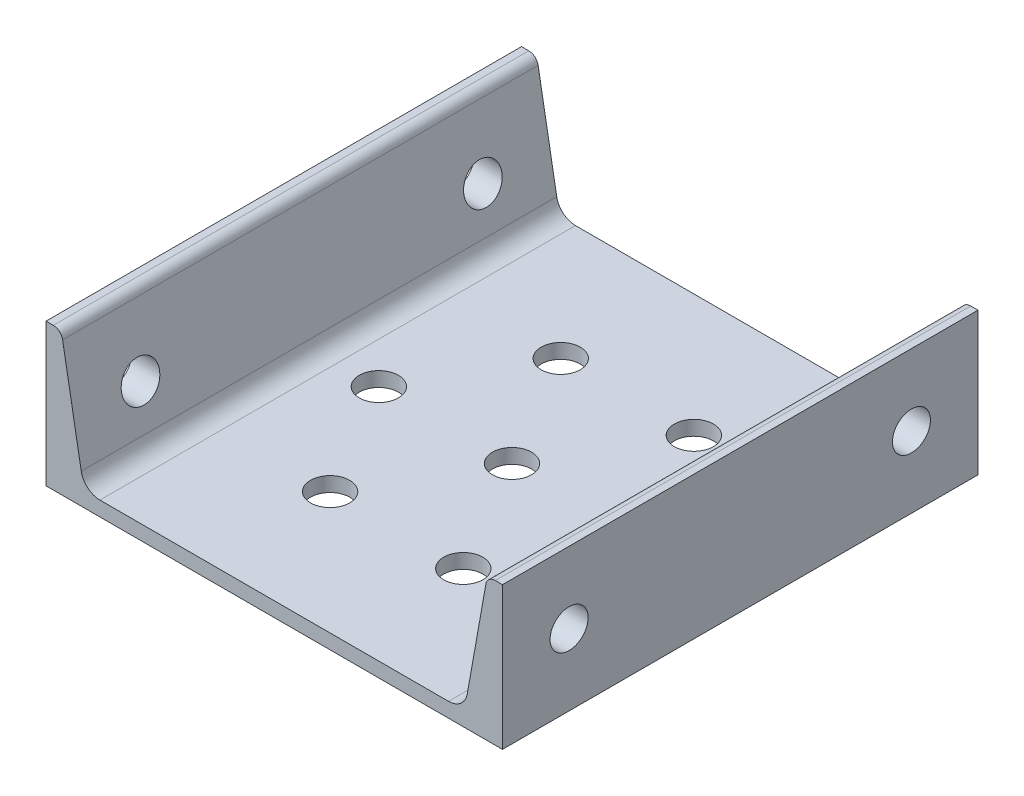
ISO-10303-21;
HEADER;
FILE_DESCRIPTION(('STEP AP214'),'2;1');
FILE_NAME('part.step','',(''),(''),'','','');
FILE_SCHEMA(('AUTOMOTIVE_DESIGN { 1 0 10303 214 1 1 1 1 }'));
ENDSEC;
DATA;
#1=APPLICATION_CONTEXT('core data for automotive mechanical design processes');
#2=APPLICATION_PROTOCOL_DEFINITION('international standard','automotive_design',2000,#1);
#3=PRODUCT_CONTEXT('',#1,'mechanical');
#4=PRODUCT('Part','Part','',(#3));
#5=PRODUCT_RELATED_PRODUCT_CATEGORY('part','',(#4));
#6=PRODUCT_DEFINITION_FORMATION('','',#4);
#7=PRODUCT_DEFINITION_CONTEXT('part definition',#1,'design');
#8=PRODUCT_DEFINITION('design','',#6,#7);
#9=PRODUCT_DEFINITION_SHAPE('','',#8);
#10=(LENGTH_UNIT() NAMED_UNIT(*) SI_UNIT(.MILLI.,.METRE.));
#11=(NAMED_UNIT(*) PLANE_ANGLE_UNIT() SI_UNIT($,.RADIAN.));
#12=(NAMED_UNIT(*) SI_UNIT($,.STERADIAN.) SOLID_ANGLE_UNIT());
#13=UNCERTAINTY_MEASURE_WITH_UNIT(LENGTH_MEASURE(1.E-05),#10,'distance_accuracy_value','');
#14=(GEOMETRIC_REPRESENTATION_CONTEXT(3) GLOBAL_UNCERTAINTY_ASSIGNED_CONTEXT((#13)) GLOBAL_UNIT_ASSIGNED_CONTEXT((#10,
#11,#12)) REPRESENTATION_CONTEXT('',''));
#15=CARTESIAN_POINT('',(0.,0.,0.));
#16=DIRECTION('',(0.,0.,1.));
#17=DIRECTION('',(1.,0.,0.));
#18=AXIS2_PLACEMENT_3D('',#15,#16,#17);
#19=CARTESIAN_POINT('',(152.4,0.,-158.75));
#20=DIRECTION('',(0.,-1.,0.));
#21=DIRECTION('',(0.,0.,-1.));
#22=AXIS2_PLACEMENT_3D('',#19,#20,#21);
#23=PLANE('',#22);
#24=CARTESIAN_POINT('',(31.75,0.,-79.3749999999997));
#25=DIRECTION('',(0.,1.,0.));
#26=DIRECTION('',(0.,0.,1.));
#27=AXIS2_PLACEMENT_3D('',#24,#25,#26);
#28=CIRCLE('',#27,6.54050000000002);
#29=CARTESIAN_POINT('',(31.75,0.,-72.8344999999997));
#30=VERTEX_POINT('',#29);
#31=EDGE_CURVE('E293',#30,#30,#28,.T.);
#32=ORIENTED_EDGE('',*,*,#31,.T.);
#33=EDGE_LOOP('',(#32));
#34=FACE_BOUND('',#33,.T.);
#35=CARTESIAN_POINT('',(53.9749999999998,0.,-117.869829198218));
#36=DIRECTION('',(0.,1.,0.));
#37=DIRECTION('',(0.,0.,1.));
#38=AXIS2_PLACEMENT_3D('',#35,#36,#37);
#39=CIRCLE('',#38,6.5405);
#40=CARTESIAN_POINT('',(53.9749999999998,0.,-111.329329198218));
#41=VERTEX_POINT('',#40);
#42=EDGE_CURVE('E287',#41,#41,#39,.T.);
#43=ORIENTED_EDGE('',*,*,#42,.T.);
#44=EDGE_LOOP('',(#43));
#45=FACE_BOUND('',#44,.T.);
#46=CARTESIAN_POINT('',(76.2,0.,-79.375));
#47=DIRECTION('',(0.,1.,0.));
#48=DIRECTION('',(0.,0.,1.));
#49=AXIS2_PLACEMENT_3D('',#46,#47,#48);
#50=CIRCLE('',#49,6.54050000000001);
#51=CARTESIAN_POINT('',(76.2,0.,-72.8345));
#52=VERTEX_POINT('',#51);
#53=EDGE_CURVE('E280',#52,#52,#50,.T.);
#54=ORIENTED_EDGE('',*,*,#53,.T.);
#55=EDGE_LOOP('',(#54));
#56=FACE_BOUND('',#55,.T.);
#57=CARTESIAN_POINT('',(53.9750000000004,0.,-40.8801708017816));
#58=DIRECTION('',(0.,1.,0.));
#59=DIRECTION('',(0.,0.,1.));
#60=AXIS2_PLACEMENT_3D('',#57,#58,#59);
#61=CIRCLE('',#60,6.54050000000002);
#62=CARTESIAN_POINT('',(53.9750000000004,0.,-34.3396708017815));
#63=VERTEX_POINT('',#62);
#64=EDGE_CURVE('E311',#63,#63,#61,.T.);
#65=ORIENTED_EDGE('',*,*,#64,.T.);
#66=EDGE_LOOP('',(#65));
#67=FACE_BOUND('',#66,.T.);
#68=CARTESIAN_POINT('',(98.4250000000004,0.,-40.8801708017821));
#69=DIRECTION('',(0.,1.,0.));
#70=DIRECTION('',(0.,0.,1.));
#71=AXIS2_PLACEMENT_3D('',#68,#69,#70);
#72=CIRCLE('',#71,6.54050000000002);
#73=CARTESIAN_POINT('',(98.4250000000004,0.,-34.339670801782));
#74=VERTEX_POINT('',#73);
#75=EDGE_CURVE('E305',#74,#74,#72,.T.);
#76=ORIENTED_EDGE('',*,*,#75,.T.);
#77=EDGE_LOOP('',(#76));
#78=FACE_BOUND('',#77,.T.);
#79=CARTESIAN_POINT('',(120.65,0.,-79.375));
#80=DIRECTION('',(0.,1.,0.));
#81=DIRECTION('',(0.,0.,1.));
#82=AXIS2_PLACEMENT_3D('',#79,#80,#81);
#83=CIRCLE('',#82,6.54050000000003);
#84=CARTESIAN_POINT('',(120.65,0.,-72.8345));
#85=VERTEX_POINT('',#84);
#86=EDGE_CURVE('E298',#85,#85,#83,.T.);
#87=ORIENTED_EDGE('',*,*,#86,.T.);
#88=EDGE_LOOP('',(#87));
#89=FACE_BOUND('',#88,.T.);
#90=CARTESIAN_POINT('',(98.4249999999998,0.,-117.869829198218));
#91=DIRECTION('',(0.,1.,0.));
#92=DIRECTION('',(0.,0.,1.));
#93=AXIS2_PLACEMENT_3D('',#90,#91,#92);
#94=CIRCLE('',#93,6.5405);
#95=CARTESIAN_POINT('',(98.4249999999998,0.,-111.329329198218));
#96=VERTEX_POINT('',#95);
#97=EDGE_CURVE('E159',#96,#96,#94,.T.);
#98=ORIENTED_EDGE('',*,*,#97,.T.);
#99=EDGE_LOOP('',(#98));
#100=FACE_BOUND('',#99,.T.);
#101=DIRECTION('',(1.,0.,0.));
#102=VECTOR('',#101,1.);
#103=CARTESIAN_POINT('',(152.4,0.,0.));
#104=LINE('',#103,#102);
#105=CARTESIAN_POINT('',(0.,0.,0.));
#106=VERTEX_POINT('',#105);
#107=CARTESIAN_POINT('',(152.4,0.,0.));
#108=VERTEX_POINT('',#107);
#109=EDGE_CURVE('E155',#106,#108,#104,.T.);
#110=ORIENTED_EDGE('',*,*,#109,.F.);
#111=DIRECTION('',(0.,0.,1.));
#112=VECTOR('',#111,1.);
#113=CARTESIAN_POINT('',(0.,0.,-158.75));
#114=LINE('',#113,#112);
#115=CARTESIAN_POINT('',(0.,0.,-158.75));
#116=VERTEX_POINT('',#115);
#117=EDGE_CURVE('E11',#116,#106,#114,.T.);
#118=ORIENTED_EDGE('',*,*,#117,.F.);
#119=DIRECTION('',(1.,0.,0.));
#120=VECTOR('',#119,1.);
#121=CARTESIAN_POINT('',(152.4,0.,-158.75));
#122=LINE('',#121,#120);
#123=CARTESIAN_POINT('',(152.4,0.,-158.75));
#124=VERTEX_POINT('',#123);
#125=EDGE_CURVE('E188',#116,#124,#122,.T.);
#126=ORIENTED_EDGE('',*,*,#125,.T.);
#127=DIRECTION('',(0.,0.,1.));
#128=VECTOR('',#127,1.);
#129=CARTESIAN_POINT('',(152.4,0.,-158.75));
#130=LINE('',#129,#128);
#131=EDGE_CURVE('E37',#124,#108,#130,.T.);
#132=ORIENTED_EDGE('',*,*,#131,.T.);
#133=EDGE_LOOP('',(#110,#118,#126,#132));
#134=FACE_BOUND('',#133,.T.);
#135=ADVANCED_FACE('F34',(#34,#45,#56,#67,#78,#89,#100,#134),#23,.T.);
#136=CARTESIAN_POINT('',(0.,0.,-158.75));
#137=DIRECTION('',(-1.,0.,0.));
#138=DIRECTION('',(0.,0.,1.));
#139=AXIS2_PLACEMENT_3D('',#136,#137,#138);
#140=PLANE('',#139);
#141=CARTESIAN_POINT('',(0.,23.8125,-22.225));
#142=DIRECTION('',(-1.,0.,0.));
#143=DIRECTION('',(0.,0.,1.));
#144=AXIS2_PLACEMENT_3D('',#141,#142,#143);
#145=CIRCLE('',#144,6.35);
#146=CARTESIAN_POINT('',(0.,23.8125,-15.875));
#147=VERTEX_POINT('',#146);
#148=EDGE_CURVE('E408',#147,#147,#145,.T.);
#149=ORIENTED_EDGE('',*,*,#148,.F.);
#150=EDGE_LOOP('',(#149));
#151=FACE_BOUND('',#150,.T.);
#152=CARTESIAN_POINT('',(0.,23.8125,-136.525));
#153=DIRECTION('',(-1.,0.,0.));
#154=DIRECTION('',(0.,0.,1.));
#155=AXIS2_PLACEMENT_3D('',#152,#153,#154);
#156=CIRCLE('',#155,6.35);
#157=CARTESIAN_POINT('',(0.,23.8125,-130.175));
#158=VERTEX_POINT('',#157);
#159=EDGE_CURVE('E266',#158,#158,#156,.T.);
#160=ORIENTED_EDGE('',*,*,#159,.F.);
#161=EDGE_LOOP('',(#160));
#162=FACE_BOUND('',#161,.T.);
#163=DIRECTION('',(0.,-1.,0.));
#164=VECTOR('',#163,1.);
#165=CARTESIAN_POINT('',(0.,0.,0.));
#166=LINE('',#165,#164);
#167=CARTESIAN_POINT('',(0.,47.625,0.));
#168=VERTEX_POINT('',#167);
#169=EDGE_CURVE('E186',#168,#106,#166,.T.);
#170=ORIENTED_EDGE('',*,*,#169,.F.);
#171=DIRECTION('',(0.,0.,1.));
#172=VECTOR('',#171,1.);
#173=CARTESIAN_POINT('',(0.,47.625,-158.75));
#174=LINE('',#173,#172);
#175=CARTESIAN_POINT('',(0.,47.625,-158.75));
#176=VERTEX_POINT('',#175);
#177=EDGE_CURVE('E43',#176,#168,#174,.T.);
#178=ORIENTED_EDGE('',*,*,#177,.F.);
#179=DIRECTION('',(0.,-1.,0.));
#180=VECTOR('',#179,1.);
#181=CARTESIAN_POINT('',(0.,0.,-158.75));
#182=LINE('',#181,#180);
#183=EDGE_CURVE('E145',#176,#116,#182,.T.);
#184=ORIENTED_EDGE('',*,*,#183,.T.);
#185=ORIENTED_EDGE('',*,*,#117,.T.);
#186=EDGE_LOOP('',(#170,#178,#184,#185));
#187=FACE_BOUND('',#186,.T.);
#188=ADVANCED_FACE('F208',(#151,#162,#187),#140,.T.);
#189=CARTESIAN_POINT('',(0.,47.625,-158.75));
#190=DIRECTION('',(0.,1.,0.));
#191=DIRECTION('',(0.,0.,1.));
#192=AXIS2_PLACEMENT_3D('',#189,#190,#191);
#193=PLANE('',#192);
#194=DIRECTION('',(-1.,0.,0.));
#195=VECTOR('',#194,1.);
#196=CARTESIAN_POINT('',(0.,47.625,0.));
#197=LINE('',#196,#195);
#198=CARTESIAN_POINT('',(2.42104526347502,47.625,0.));
#199=VERTEX_POINT('',#198);
#200=EDGE_CURVE('E132',#199,#168,#197,.T.);
#201=ORIENTED_EDGE('',*,*,#200,.F.);
#202=DIRECTION('',(0.,0.,1.));
#203=VECTOR('',#202,1.);
#204=CARTESIAN_POINT('',(2.42104526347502,47.625,-158.75));
#205=LINE('',#204,#203);
#206=CARTESIAN_POINT('',(2.42104526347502,47.625,-158.75));
#207=VERTEX_POINT('',#206);
#208=EDGE_CURVE('E127',#207,#199,#205,.T.);
#209=ORIENTED_EDGE('',*,*,#208,.F.);
#210=DIRECTION('',(-1.,0.,0.));
#211=VECTOR('',#210,1.);
#212=CARTESIAN_POINT('',(0.,47.625,-158.75));
#213=LINE('',#212,#211);
#214=EDGE_CURVE('E130',#207,#176,#213,.T.);
#215=ORIENTED_EDGE('',*,*,#214,.T.);
#216=ORIENTED_EDGE('',*,*,#177,.T.);
#217=EDGE_LOOP('',(#201,#209,#215,#216));
#218=FACE_BOUND('',#217,.T.);
#219=ADVANCED_FACE('F129',(#218),#193,.T.);
#220=CARTESIAN_POINT('',(2.42104526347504,44.45,-158.75));
#221=DIRECTION('',(0.,0.,1.));
#222=DIRECTION('',(1.,0.,0.));
#223=AXIS2_PLACEMENT_3D('',#220,#221,#222);
#224=CYLINDRICAL_SURFACE('',#223,3.175);
#225=CARTESIAN_POINT('',(2.42104526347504,44.45,0.));
#226=DIRECTION('',(0.,0.,1.));
#227=DIRECTION('',(-1.,0.,0.));
#228=AXIS2_PLACEMENT_3D('',#225,#226,#227);
#229=CIRCLE('',#228,3.175);
#230=CARTESIAN_POINT('',(5.54674623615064,45.0073315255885,0.));
#231=VERTEX_POINT('',#230);
#232=EDGE_CURVE('E183',#231,#199,#229,.T.);
#233=ORIENTED_EDGE('',*,*,#232,.F.);
#234=DIRECTION('',(0.,0.,1.));
#235=VECTOR('',#234,1.);
#236=CARTESIAN_POINT('',(5.54674623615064,45.0073315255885,-158.75));
#237=LINE('',#236,#235);
#238=CARTESIAN_POINT('',(5.54674623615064,45.0073315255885,-158.75));
#239=VERTEX_POINT('',#238);
#240=EDGE_CURVE('E137',#239,#231,#237,.T.);
#241=ORIENTED_EDGE('',*,*,#240,.F.);
#242=CARTESIAN_POINT('',(2.42104526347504,44.45,-158.75));
#243=DIRECTION('',(0.,0.,1.));
#244=DIRECTION('',(-1.,0.,0.));
#245=AXIS2_PLACEMENT_3D('',#242,#243,#244);
#246=CIRCLE('',#245,3.175);
#247=EDGE_CURVE('E143',#239,#207,#246,.T.);
#248=ORIENTED_EDGE('',*,*,#247,.T.);
#249=ORIENTED_EDGE('',*,*,#208,.T.);
#250=EDGE_LOOP('',(#233,#241,#248,#249));
#251=FACE_BOUND('',#250,.T.);
#252=ADVANCED_FACE('F147',(#251),#224,.T.);
#253=CARTESIAN_POINT('',(5.54674623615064,45.0073315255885,-158.75));
#254=DIRECTION('',(0.984472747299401,0.175537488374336,0.));
#255=DIRECTION('',(-0.175537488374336,0.984472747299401,0.));
#256=AXIS2_PLACEMENT_3D('',#253,#254,#255);
#257=PLANE('',#256);
#258=CARTESIAN_POINT('',(9.32591381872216,23.8125,-22.225));
#259=DIRECTION('',(0.984472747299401,0.175537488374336,0.));
#260=DIRECTION('',(-0.175537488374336,0.984472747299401,0.));
#261=AXIS2_PLACEMENT_3D('',#258,#259,#260);
#262=ELLIPSE('',#261,6.4501531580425,6.35);
#263=CARTESIAN_POINT('',(8.19367013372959,30.1625,-22.225));
#264=VERTEX_POINT('',#263);
#265=EDGE_CURVE('E272',#264,#264,#262,.T.);
#266=ORIENTED_EDGE('',*,*,#265,.F.);
#267=EDGE_LOOP('',(#266));
#268=FACE_BOUND('',#267,.T.);
#269=CARTESIAN_POINT('',(9.32591381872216,23.8125,-136.525));
#270=DIRECTION('',(0.984472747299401,0.175537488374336,0.));
#271=DIRECTION('',(-0.175537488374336,0.984472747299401,0.));
#272=AXIS2_PLACEMENT_3D('',#269,#270,#271);
#273=ELLIPSE('',#272,6.45015315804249,6.35);
#274=CARTESIAN_POINT('',(8.1936701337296,30.1625,-136.525));
#275=VERTEX_POINT('',#274);
#276=EDGE_CURVE('E269',#275,#275,#273,.T.);
#277=ORIENTED_EDGE('',*,*,#276,.F.);
#278=EDGE_LOOP('',(#277));
#279=FACE_BOUND('',#278,.T.);
#280=DIRECTION('',(-0.175537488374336,0.984472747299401,0.));
#281=VECTOR('',#280,1.);
#282=CARTESIAN_POINT('',(5.54674623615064,45.0073315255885,0.));
#283=LINE('',#282,#281);
#284=CARTESIAN_POINT('',(11.7665075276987,10.124836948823,0.));
#285=VERTEX_POINT('',#284);
#286=EDGE_CURVE('E180',#285,#231,#283,.T.);
#287=ORIENTED_EDGE('',*,*,#286,.F.);
#288=DIRECTION('',(0.,0.,1.));
#289=VECTOR('',#288,1.);
#290=CARTESIAN_POINT('',(11.7665075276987,10.124836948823,-158.75));
#291=LINE('',#290,#289);
#292=CARTESIAN_POINT('',(11.7665075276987,10.124836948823,-158.75));
#293=VERTEX_POINT('',#292);
#294=EDGE_CURVE('E192',#293,#285,#291,.T.);
#295=ORIENTED_EDGE('',*,*,#294,.F.);
#296=DIRECTION('',(-0.175537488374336,0.984472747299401,0.));
#297=VECTOR('',#296,1.);
#298=CARTESIAN_POINT('',(5.54674623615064,45.0073315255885,-158.75));
#299=LINE('',#298,#297);
#300=EDGE_CURVE('E148',#293,#239,#299,.T.);
#301=ORIENTED_EDGE('',*,*,#300,.T.);
#302=ORIENTED_EDGE('',*,*,#240,.T.);
#303=EDGE_LOOP('',(#287,#295,#301,#302));
#304=FACE_BOUND('',#303,.T.);
#305=ADVANCED_FACE('F225',(#268,#279,#304),#257,.T.);
#306=CARTESIAN_POINT('',(18.0179094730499,11.2395,-158.75));
#307=DIRECTION('',(0.,0.,1.));
#308=DIRECTION('',(1.,0.,0.));
#309=AXIS2_PLACEMENT_3D('',#306,#307,#308);
#310=CYLINDRICAL_SURFACE('',#309,6.35);
#311=CARTESIAN_POINT('',(18.0179094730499,11.2395,0.));
#312=DIRECTION('',(0.,0.,-1.));
#313=DIRECTION('',(1.,0.,0.));
#314=AXIS2_PLACEMENT_3D('',#311,#312,#313);
#315=CIRCLE('',#314,6.35);
#316=CARTESIAN_POINT('',(18.01790947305,4.88949999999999,0.));
#317=VERTEX_POINT('',#316);
#318=EDGE_CURVE('E177',#317,#285,#315,.T.);
#319=ORIENTED_EDGE('',*,*,#318,.F.);
#320=DIRECTION('',(0.,0.,1.));
#321=VECTOR('',#320,1.);
#322=CARTESIAN_POINT('',(18.01790947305,4.88949999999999,-158.75));
#323=LINE('',#322,#321);
#324=CARTESIAN_POINT('',(18.01790947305,4.88949999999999,-158.75));
#325=VERTEX_POINT('',#324);
#326=EDGE_CURVE('E194',#325,#317,#323,.T.);
#327=ORIENTED_EDGE('',*,*,#326,.F.);
#328=CARTESIAN_POINT('',(18.0179094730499,11.2395,-158.75));
#329=DIRECTION('',(0.,0.,-1.));
#330=DIRECTION('',(1.,0.,0.));
#331=AXIS2_PLACEMENT_3D('',#328,#329,#330);
#332=CIRCLE('',#331,6.35);
#333=EDGE_CURVE('E150',#325,#293,#332,.T.);
#334=ORIENTED_EDGE('',*,*,#333,.T.);
#335=ORIENTED_EDGE('',*,*,#294,.T.);
#336=EDGE_LOOP('',(#319,#327,#334,#335));
#337=FACE_BOUND('',#336,.T.);
#338=ADVANCED_FACE('F228',(#337),#310,.F.);
#339=CARTESIAN_POINT('',(18.01790947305,4.88949999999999,-158.75));
#340=DIRECTION('',(0.,1.,0.));
#341=DIRECTION('',(0.,0.,1.));
#342=AXIS2_PLACEMENT_3D('',#339,#340,#341);
#343=PLANE('',#342);
#344=CARTESIAN_POINT('',(31.75,4.88949999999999,-79.3749999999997));
#345=DIRECTION('',(0.,1.,0.));
#346=DIRECTION('',(0.,0.,1.));
#347=AXIS2_PLACEMENT_3D('',#344,#345,#346);
#348=CIRCLE('',#347,6.54050000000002);
#349=CARTESIAN_POINT('',(31.75,4.88949999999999,-72.8344999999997));
#350=VERTEX_POINT('',#349);
#351=EDGE_CURVE('E279',#350,#350,#348,.T.);
#352=ORIENTED_EDGE('',*,*,#351,.F.);
#353=EDGE_LOOP('',(#352));
#354=FACE_BOUND('',#353,.T.);
#355=CARTESIAN_POINT('',(53.9749999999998,4.88949999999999,-117.869829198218));
#356=DIRECTION('',(0.,1.,0.));
#357=DIRECTION('',(0.,0.,1.));
#358=AXIS2_PLACEMENT_3D('',#355,#356,#357);
#359=CIRCLE('',#358,6.5405);
#360=CARTESIAN_POINT('',(53.9749999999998,4.88949999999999,-111.329329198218));
#361=VERTEX_POINT('',#360);
#362=EDGE_CURVE('E290',#361,#361,#359,.T.);
#363=ORIENTED_EDGE('',*,*,#362,.F.);
#364=EDGE_LOOP('',(#363));
#365=FACE_BOUND('',#364,.T.);
#366=CARTESIAN_POINT('',(76.2,4.88949999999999,-79.375));
#367=DIRECTION('',(0.,1.,0.));
#368=DIRECTION('',(0.,0.,1.));
#369=AXIS2_PLACEMENT_3D('',#366,#367,#368);
#370=CIRCLE('',#369,6.54050000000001);
#371=CARTESIAN_POINT('',(76.2,4.88949999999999,-72.8345));
#372=VERTEX_POINT('',#371);
#373=EDGE_CURVE('E284',#372,#372,#370,.T.);
#374=ORIENTED_EDGE('',*,*,#373,.F.);
#375=EDGE_LOOP('',(#374));
#376=FACE_BOUND('',#375,.T.);
#377=CARTESIAN_POINT('',(53.9750000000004,4.88949999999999,-40.8801708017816));
#378=DIRECTION('',(0.,1.,0.));
#379=DIRECTION('',(0.,0.,1.));
#380=AXIS2_PLACEMENT_3D('',#377,#378,#379);
#381=CIRCLE('',#380,6.54050000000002);
#382=CARTESIAN_POINT('',(53.9750000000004,4.88949999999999,-34.3396708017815));
#383=VERTEX_POINT('',#382);
#384=EDGE_CURVE('E283',#383,#383,#381,.T.);
#385=ORIENTED_EDGE('',*,*,#384,.F.);
#386=EDGE_LOOP('',(#385));
#387=FACE_BOUND('',#386,.T.);
#388=CARTESIAN_POINT('',(98.4250000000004,4.88949999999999,-40.8801708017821));
#389=DIRECTION('',(0.,1.,0.));
#390=DIRECTION('',(0.,0.,1.));
#391=AXIS2_PLACEMENT_3D('',#388,#389,#390);
#392=CIRCLE('',#391,6.54050000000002);
#393=CARTESIAN_POINT('',(98.4250000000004,4.88949999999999,-34.339670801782));
#394=VERTEX_POINT('',#393);
#395=EDGE_CURVE('E308',#394,#394,#392,.T.);
#396=ORIENTED_EDGE('',*,*,#395,.F.);
#397=EDGE_LOOP('',(#396));
#398=FACE_BOUND('',#397,.T.);
#399=CARTESIAN_POINT('',(120.65,4.88949999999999,-79.375));
#400=DIRECTION('',(0.,1.,0.));
#401=DIRECTION('',(0.,0.,1.));
#402=AXIS2_PLACEMENT_3D('',#399,#400,#401);
#403=CIRCLE('',#402,6.54050000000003);
#404=CARTESIAN_POINT('',(120.65,4.88949999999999,-72.8345));
#405=VERTEX_POINT('',#404);
#406=EDGE_CURVE('E302',#405,#405,#403,.T.);
#407=ORIENTED_EDGE('',*,*,#406,.F.);
#408=EDGE_LOOP('',(#407));
#409=FACE_BOUND('',#408,.T.);
#410=CARTESIAN_POINT('',(98.4249999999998,4.88949999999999,-117.869829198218));
#411=DIRECTION('',(0.,1.,0.));
#412=DIRECTION('',(0.,0.,1.));
#413=AXIS2_PLACEMENT_3D('',#410,#411,#412);
#414=CIRCLE('',#413,6.5405);
#415=CARTESIAN_POINT('',(98.4249999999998,4.88949999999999,-111.329329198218));
#416=VERTEX_POINT('',#415);
#417=EDGE_CURVE('E301',#416,#416,#414,.T.);
#418=ORIENTED_EDGE('',*,*,#417,.F.);
#419=EDGE_LOOP('',(#418));
#420=FACE_BOUND('',#419,.T.);
#421=DIRECTION('',(-1.,0.,0.));
#422=VECTOR('',#421,1.);
#423=CARTESIAN_POINT('',(18.01790947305,4.88949999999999,0.));
#424=LINE('',#423,#422);
#425=CARTESIAN_POINT('',(134.38209052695,4.88949999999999,0.));
#426=VERTEX_POINT('',#425);
#427=EDGE_CURVE('E174',#426,#317,#424,.T.);
#428=ORIENTED_EDGE('',*,*,#427,.F.);
#429=DIRECTION('',(0.,0.,1.));
#430=VECTOR('',#429,1.);
#431=CARTESIAN_POINT('',(134.38209052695,4.88949999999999,-158.75));
#432=LINE('',#431,#430);
#433=CARTESIAN_POINT('',(134.38209052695,4.88949999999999,-158.75));
#434=VERTEX_POINT('',#433);
#435=EDGE_CURVE('E196',#434,#426,#432,.T.);
#436=ORIENTED_EDGE('',*,*,#435,.F.);
#437=DIRECTION('',(-1.,0.,0.));
#438=VECTOR('',#437,1.);
#439=CARTESIAN_POINT('',(18.01790947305,4.88949999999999,-158.75));
#440=LINE('',#439,#438);
#441=EDGE_CURVE('E335',#434,#325,#440,.T.);
#442=ORIENTED_EDGE('',*,*,#441,.T.);
#443=ORIENTED_EDGE('',*,*,#326,.T.);
#444=EDGE_LOOP('',(#428,#436,#442,#443));
#445=FACE_BOUND('',#444,.T.);
#446=ADVANCED_FACE('F232',(#354,#365,#376,#387,#398,#409,#420,#445),#343,.T.);
#447=CARTESIAN_POINT('',(134.38209052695,11.2395,-158.75));
#448=DIRECTION('',(0.,0.,1.));
#449=DIRECTION('',(1.,0.,0.));
#450=AXIS2_PLACEMENT_3D('',#447,#448,#449);
#451=CYLINDRICAL_SURFACE('',#450,6.34999999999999);
#452=CARTESIAN_POINT('',(134.38209052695,11.2395,0.));
#453=DIRECTION('',(0.,0.,-1.));
#454=DIRECTION('',(-1.,0.,0.));
#455=AXIS2_PLACEMENT_3D('',#452,#453,#454);
#456=CIRCLE('',#455,6.34999999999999);
#457=CARTESIAN_POINT('',(140.633492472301,10.124836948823,0.));
#458=VERTEX_POINT('',#457);
#459=EDGE_CURVE('E171',#458,#426,#456,.T.);
#460=ORIENTED_EDGE('',*,*,#459,.F.);
#461=DIRECTION('',(0.,0.,1.));
#462=VECTOR('',#461,1.);
#463=CARTESIAN_POINT('',(140.633492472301,10.124836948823,-158.75));
#464=LINE('',#463,#462);
#465=CARTESIAN_POINT('',(140.633492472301,10.124836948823,-158.75));
#466=VERTEX_POINT('',#465);
#467=EDGE_CURVE('E198',#466,#458,#464,.T.);
#468=ORIENTED_EDGE('',*,*,#467,.F.);
#469=CARTESIAN_POINT('',(134.38209052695,11.2395,-158.75));
#470=DIRECTION('',(0.,0.,-1.));
#471=DIRECTION('',(-1.,0.,0.));
#472=AXIS2_PLACEMENT_3D('',#469,#470,#471);
#473=CIRCLE('',#472,6.34999999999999);
#474=EDGE_CURVE('E332',#466,#434,#473,.T.);
#475=ORIENTED_EDGE('',*,*,#474,.T.);
#476=ORIENTED_EDGE('',*,*,#435,.T.);
#477=EDGE_LOOP('',(#460,#468,#475,#476));
#478=FACE_BOUND('',#477,.T.);
#479=ADVANCED_FACE('F236',(#478),#451,.F.);
#480=CARTESIAN_POINT('',(146.853253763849,45.0073315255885,-158.75));
#481=DIRECTION('',(-0.984472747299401,0.175537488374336,0.));
#482=DIRECTION('',(-0.175537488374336,-0.984472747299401,0.));
#483=AXIS2_PLACEMENT_3D('',#480,#481,#482);
#484=PLANE('',#483);
#485=CARTESIAN_POINT('',(143.074086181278,23.8125,-22.225));
#486=DIRECTION('',(-0.984472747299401,0.175537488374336,0.));
#487=DIRECTION('',(-0.175537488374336,-0.984472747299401,0.));
#488=AXIS2_PLACEMENT_3D('',#485,#486,#487);
#489=ELLIPSE('',#488,6.4501531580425,6.35);
#490=CARTESIAN_POINT('',(141.941842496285,17.4625,-22.225));
#491=VERTEX_POINT('',#490);
#492=EDGE_CURVE('E407',#491,#491,#489,.T.);
#493=ORIENTED_EDGE('',*,*,#492,.F.);
#494=EDGE_LOOP('',(#493));
#495=FACE_BOUND('',#494,.T.);
#496=CARTESIAN_POINT('',(143.074086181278,23.8125,-136.525));
#497=DIRECTION('',(-0.984472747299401,0.175537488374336,0.));
#498=DIRECTION('',(-0.175537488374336,-0.984472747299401,0.));
#499=AXIS2_PLACEMENT_3D('',#496,#497,#498);
#500=ELLIPSE('',#499,6.45015315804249,6.35);
#501=CARTESIAN_POINT('',(141.941842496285,17.4625,-136.525));
#502=VERTEX_POINT('',#501);
#503=EDGE_CURVE('E265',#502,#502,#500,.T.);
#504=ORIENTED_EDGE('',*,*,#503,.F.);
#505=EDGE_LOOP('',(#504));
#506=FACE_BOUND('',#505,.T.);
#507=DIRECTION('',(-0.175537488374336,-0.984472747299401,0.));
#508=VECTOR('',#507,1.);
#509=CARTESIAN_POINT('',(146.853253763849,45.0073315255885,0.));
#510=LINE('',#509,#508);
#511=CARTESIAN_POINT('',(146.853253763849,45.0073315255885,0.));
#512=VERTEX_POINT('',#511);
#513=EDGE_CURVE('E168',#512,#458,#510,.T.);
#514=ORIENTED_EDGE('',*,*,#513,.F.);
#515=DIRECTION('',(0.,0.,1.));
#516=VECTOR('',#515,1.);
#517=CARTESIAN_POINT('',(146.853253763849,45.0073315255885,-158.75));
#518=LINE('',#517,#516);
#519=CARTESIAN_POINT('',(146.853253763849,45.0073315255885,-158.75));
#520=VERTEX_POINT('',#519);
#521=EDGE_CURVE('E200',#520,#512,#518,.T.);
#522=ORIENTED_EDGE('',*,*,#521,.F.);
#523=DIRECTION('',(-0.175537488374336,-0.984472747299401,0.));
#524=VECTOR('',#523,1.);
#525=CARTESIAN_POINT('',(146.853253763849,45.0073315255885,-158.75));
#526=LINE('',#525,#524);
#527=EDGE_CURVE('E329',#520,#466,#526,.T.);
#528=ORIENTED_EDGE('',*,*,#527,.T.);
#529=ORIENTED_EDGE('',*,*,#467,.T.);
#530=EDGE_LOOP('',(#514,#522,#528,#529));
#531=FACE_BOUND('',#530,.T.);
#532=ADVANCED_FACE('F240',(#495,#506,#531),#484,.T.);
#533=CARTESIAN_POINT('',(149.978954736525,44.45,-158.75));
#534=DIRECTION('',(0.,0.,1.));
#535=DIRECTION('',(1.,0.,0.));
#536=AXIS2_PLACEMENT_3D('',#533,#534,#535);
#537=CYLINDRICAL_SURFACE('',#536,3.17499999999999);
#538=CARTESIAN_POINT('',(149.978954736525,44.45,0.));
#539=DIRECTION('',(0.,0.,1.));
#540=DIRECTION('',(1.,0.,0.));
#541=AXIS2_PLACEMENT_3D('',#538,#539,#540);
#542=CIRCLE('',#541,3.17499999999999);
#543=CARTESIAN_POINT('',(149.978954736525,47.625,0.));
#544=VERTEX_POINT('',#543);
#545=EDGE_CURVE('E165',#544,#512,#542,.T.);
#546=ORIENTED_EDGE('',*,*,#545,.F.);
#547=DIRECTION('',(0.,0.,1.));
#548=VECTOR('',#547,1.);
#549=CARTESIAN_POINT('',(149.978954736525,47.625,-158.75));
#550=LINE('',#549,#548);
#551=CARTESIAN_POINT('',(149.978954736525,47.625,-158.75));
#552=VERTEX_POINT('',#551);
#553=EDGE_CURVE('E202',#552,#544,#550,.T.);
#554=ORIENTED_EDGE('',*,*,#553,.F.);
#555=CARTESIAN_POINT('',(149.978954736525,44.45,-158.75));
#556=DIRECTION('',(0.,0.,1.));
#557=DIRECTION('',(1.,0.,0.));
#558=AXIS2_PLACEMENT_3D('',#555,#556,#557);
#559=CIRCLE('',#558,3.17499999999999);
#560=EDGE_CURVE('E326',#552,#520,#559,.T.);
#561=ORIENTED_EDGE('',*,*,#560,.T.);
#562=ORIENTED_EDGE('',*,*,#521,.T.);
#563=EDGE_LOOP('',(#546,#554,#561,#562));
#564=FACE_BOUND('',#563,.T.);
#565=ADVANCED_FACE('F244',(#564),#537,.T.);
#566=CARTESIAN_POINT('',(152.4,47.625,-158.75));
#567=DIRECTION('',(0.,1.,0.));
#568=DIRECTION('',(0.,0.,1.));
#569=AXIS2_PLACEMENT_3D('',#566,#567,#568);
#570=PLANE('',#569);
#571=DIRECTION('',(-1.,0.,0.));
#572=VECTOR('',#571,1.);
#573=CARTESIAN_POINT('',(152.4,47.625,0.));
#574=LINE('',#573,#572);
#575=CARTESIAN_POINT('',(152.4,47.625,0.));
#576=VERTEX_POINT('',#575);
#577=EDGE_CURVE('E162',#576,#544,#574,.T.);
#578=ORIENTED_EDGE('',*,*,#577,.F.);
#579=DIRECTION('',(0.,0.,1.));
#580=VECTOR('',#579,1.);
#581=CARTESIAN_POINT('',(152.4,47.625,-158.75));
#582=LINE('',#581,#580);
#583=CARTESIAN_POINT('',(152.4,47.625,-158.75));
#584=VERTEX_POINT('',#583);
#585=EDGE_CURVE('E203',#584,#576,#582,.T.);
#586=ORIENTED_EDGE('',*,*,#585,.F.);
#587=DIRECTION('',(-1.,0.,0.));
#588=VECTOR('',#587,1.);
#589=CARTESIAN_POINT('',(152.4,47.625,-158.75));
#590=LINE('',#589,#588);
#591=EDGE_CURVE('E323',#584,#552,#590,.T.);
#592=ORIENTED_EDGE('',*,*,#591,.T.);
#593=ORIENTED_EDGE('',*,*,#553,.T.);
#594=EDGE_LOOP('',(#578,#586,#592,#593));
#595=FACE_BOUND('',#594,.T.);
#596=ADVANCED_FACE('F248',(#595),#570,.T.);
#597=CARTESIAN_POINT('',(152.4,0.,-158.75));
#598=DIRECTION('',(1.,0.,0.));
#599=DIRECTION('',(0.,0.,-1.));
#600=AXIS2_PLACEMENT_3D('',#597,#598,#599);
#601=PLANE('',#600);
#602=CARTESIAN_POINT('',(152.4,23.8125,-22.225));
#603=DIRECTION('',(-1.,0.,0.));
#604=DIRECTION('',(0.,0.,1.));
#605=AXIS2_PLACEMENT_3D('',#602,#603,#604);
#606=CIRCLE('',#605,6.35);
#607=CARTESIAN_POINT('',(152.4,23.8125,-15.875));
#608=VERTEX_POINT('',#607);
#609=EDGE_CURVE('E260',#608,#608,#606,.T.);
#610=ORIENTED_EDGE('',*,*,#609,.T.);
#611=EDGE_LOOP('',(#610));
#612=FACE_BOUND('',#611,.T.);
#613=CARTESIAN_POINT('',(152.4,23.8125,-136.525));
#614=DIRECTION('',(-1.,0.,0.));
#615=DIRECTION('',(0.,0.,1.));
#616=AXIS2_PLACEMENT_3D('',#613,#614,#615);
#617=CIRCLE('',#616,6.35);
#618=CARTESIAN_POINT('',(152.4,23.8125,-130.175));
#619=VERTEX_POINT('',#618);
#620=EDGE_CURVE('E263',#619,#619,#617,.T.);
#621=ORIENTED_EDGE('',*,*,#620,.T.);
#622=EDGE_LOOP('',(#621));
#623=FACE_BOUND('',#622,.T.);
#624=DIRECTION('',(0.,1.,0.));
#625=VECTOR('',#624,1.);
#626=CARTESIAN_POINT('',(152.4,0.,0.));
#627=LINE('',#626,#625);
#628=EDGE_CURVE('E158',#108,#576,#627,.T.);
#629=ORIENTED_EDGE('',*,*,#628,.F.);
#630=ORIENTED_EDGE('',*,*,#131,.F.);
#631=DIRECTION('',(0.,1.,0.));
#632=VECTOR('',#631,1.);
#633=CARTESIAN_POINT('',(152.4,0.,-158.75));
#634=LINE('',#633,#632);
#635=EDGE_CURVE('E321',#124,#584,#634,.T.);
#636=ORIENTED_EDGE('',*,*,#635,.T.);
#637=ORIENTED_EDGE('',*,*,#585,.T.);
#638=EDGE_LOOP('',(#629,#630,#636,#637));
#639=FACE_BOUND('',#638,.T.);
#640=ADVANCED_FACE('F205',(#612,#623,#639),#601,.T.);
#641=CARTESIAN_POINT('',(2.42104526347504,44.45,-158.75));
#642=DIRECTION('',(0.,0.,-1.));
#643=DIRECTION('',(-1.,0.,0.));
#644=AXIS2_PLACEMENT_3D('',#641,#642,#643);
#645=PLANE('',#644);
#646=ORIENTED_EDGE('',*,*,#125,.F.);
#647=ORIENTED_EDGE('',*,*,#183,.F.);
#648=ORIENTED_EDGE('',*,*,#214,.F.);
#649=ORIENTED_EDGE('',*,*,#247,.F.);
#650=ORIENTED_EDGE('',*,*,#300,.F.);
#651=ORIENTED_EDGE('',*,*,#333,.F.);
#652=ORIENTED_EDGE('',*,*,#441,.F.);
#653=ORIENTED_EDGE('',*,*,#474,.F.);
#654=ORIENTED_EDGE('',*,*,#527,.F.);
#655=ORIENTED_EDGE('',*,*,#560,.F.);
#656=ORIENTED_EDGE('',*,*,#591,.F.);
#657=ORIENTED_EDGE('',*,*,#635,.F.);
#658=EDGE_LOOP('',(#646,#647,#648,#649,#650,#651,#652,#653,#654,#655,#656,#657));
#659=FACE_BOUND('',#658,.T.);
#660=ADVANCED_FACE('F141',(#659),#645,.T.);
#661=CARTESIAN_POINT('',(2.42104526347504,44.45,0.));
#662=DIRECTION('',(0.,0.,-1.));
#663=DIRECTION('',(-1.,0.,0.));
#664=AXIS2_PLACEMENT_3D('',#661,#662,#663);
#665=PLANE('',#664);
#666=ORIENTED_EDGE('',*,*,#109,.T.);
#667=ORIENTED_EDGE('',*,*,#628,.T.);
#668=ORIENTED_EDGE('',*,*,#577,.T.);
#669=ORIENTED_EDGE('',*,*,#545,.T.);
#670=ORIENTED_EDGE('',*,*,#513,.T.);
#671=ORIENTED_EDGE('',*,*,#459,.T.);
#672=ORIENTED_EDGE('',*,*,#427,.T.);
#673=ORIENTED_EDGE('',*,*,#318,.T.);
#674=ORIENTED_EDGE('',*,*,#286,.T.);
#675=ORIENTED_EDGE('',*,*,#232,.T.);
#676=ORIENTED_EDGE('',*,*,#200,.T.);
#677=ORIENTED_EDGE('',*,*,#169,.T.);
#678=EDGE_LOOP('',(#666,#667,#668,#669,#670,#671,#672,#673,#674,#675,#676,#677));
#679=FACE_BOUND('',#678,.T.);
#680=ADVANCED_FACE('F207',(#679),#665,.F.);
#681=CARTESIAN_POINT('',(98.4249999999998,0.,-117.869829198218));
#682=DIRECTION('',(0.,1.,0.));
#683=DIRECTION('',(0.,0.,1.));
#684=AXIS2_PLACEMENT_3D('',#681,#682,#683);
#685=CYLINDRICAL_SURFACE('',#684,6.5405);
#686=ORIENTED_EDGE('',*,*,#97,.F.);
#687=EDGE_LOOP('',(#686));
#688=FACE_BOUND('',#687,.T.);
#689=ORIENTED_EDGE('',*,*,#417,.T.);
#690=EDGE_LOOP('',(#689));
#691=FACE_BOUND('',#690,.T.);
#692=ADVANCED_FACE('F355',(#688,#691),#685,.F.);
#693=CARTESIAN_POINT('',(120.65,0.,-79.375));
#694=DIRECTION('',(0.,1.,0.));
#695=DIRECTION('',(0.,0.,1.));
#696=AXIS2_PLACEMENT_3D('',#693,#694,#695);
#697=CYLINDRICAL_SURFACE('',#696,6.54050000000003);
#698=ORIENTED_EDGE('',*,*,#86,.F.);
#699=EDGE_LOOP('',(#698));
#700=FACE_BOUND('',#699,.T.);
#701=ORIENTED_EDGE('',*,*,#406,.T.);
#702=EDGE_LOOP('',(#701));
#703=FACE_BOUND('',#702,.T.);
#704=ADVANCED_FACE('F358',(#700,#703),#697,.F.);
#705=CARTESIAN_POINT('',(98.4250000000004,0.,-40.8801708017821));
#706=DIRECTION('',(0.,1.,0.));
#707=DIRECTION('',(0.,0.,1.));
#708=AXIS2_PLACEMENT_3D('',#705,#706,#707);
#709=CYLINDRICAL_SURFACE('',#708,6.54050000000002);
#710=ORIENTED_EDGE('',*,*,#75,.F.);
#711=EDGE_LOOP('',(#710));
#712=FACE_BOUND('',#711,.T.);
#713=ORIENTED_EDGE('',*,*,#395,.T.);
#714=EDGE_LOOP('',(#713));
#715=FACE_BOUND('',#714,.T.);
#716=ADVANCED_FACE('F365',(#712,#715),#709,.F.);
#717=CARTESIAN_POINT('',(53.9750000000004,0.,-40.8801708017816));
#718=DIRECTION('',(0.,1.,0.));
#719=DIRECTION('',(0.,0.,1.));
#720=AXIS2_PLACEMENT_3D('',#717,#718,#719);
#721=CYLINDRICAL_SURFACE('',#720,6.54050000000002);
#722=ORIENTED_EDGE('',*,*,#64,.F.);
#723=EDGE_LOOP('',(#722));
#724=FACE_BOUND('',#723,.T.);
#725=ORIENTED_EDGE('',*,*,#384,.T.);
#726=EDGE_LOOP('',(#725));
#727=FACE_BOUND('',#726,.T.);
#728=ADVANCED_FACE('F370',(#724,#727),#721,.F.);
#729=CARTESIAN_POINT('',(76.2,0.,-79.375));
#730=DIRECTION('',(0.,1.,0.));
#731=DIRECTION('',(0.,0.,1.));
#732=AXIS2_PLACEMENT_3D('',#729,#730,#731);
#733=CYLINDRICAL_SURFACE('',#732,6.54050000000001);
#734=ORIENTED_EDGE('',*,*,#53,.F.);
#735=EDGE_LOOP('',(#734));
#736=FACE_BOUND('',#735,.T.);
#737=ORIENTED_EDGE('',*,*,#373,.T.);
#738=EDGE_LOOP('',(#737));
#739=FACE_BOUND('',#738,.T.);
#740=ADVANCED_FACE('F373',(#736,#739),#733,.F.);
#741=CARTESIAN_POINT('',(53.9749999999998,0.,-117.869829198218));
#742=DIRECTION('',(0.,1.,0.));
#743=DIRECTION('',(0.,0.,1.));
#744=AXIS2_PLACEMENT_3D('',#741,#742,#743);
#745=CYLINDRICAL_SURFACE('',#744,6.5405);
#746=ORIENTED_EDGE('',*,*,#42,.F.);
#747=EDGE_LOOP('',(#746));
#748=FACE_BOUND('',#747,.T.);
#749=ORIENTED_EDGE('',*,*,#362,.T.);
#750=EDGE_LOOP('',(#749));
#751=FACE_BOUND('',#750,.T.);
#752=ADVANCED_FACE('F382',(#748,#751),#745,.F.);
#753=CARTESIAN_POINT('',(31.75,0.,-79.3749999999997));
#754=DIRECTION('',(0.,1.,0.));
#755=DIRECTION('',(0.,0.,1.));
#756=AXIS2_PLACEMENT_3D('',#753,#754,#755);
#757=CYLINDRICAL_SURFACE('',#756,6.54050000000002);
#758=ORIENTED_EDGE('',*,*,#31,.F.);
#759=EDGE_LOOP('',(#758));
#760=FACE_BOUND('',#759,.T.);
#761=ORIENTED_EDGE('',*,*,#351,.T.);
#762=EDGE_LOOP('',(#761));
#763=FACE_BOUND('',#762,.T.);
#764=ADVANCED_FACE('F378',(#760,#763),#757,.F.);
#765=CARTESIAN_POINT('',(152.4,23.8125,-136.525));
#766=DIRECTION('',(-1.,0.,0.));
#767=DIRECTION('',(0.,0.,1.));
#768=AXIS2_PLACEMENT_3D('',#765,#766,#767);
#769=CYLINDRICAL_SURFACE('',#768,6.35);
#770=ORIENTED_EDGE('',*,*,#503,.T.);
#771=EDGE_LOOP('',(#770));
#772=FACE_BOUND('',#771,.T.);
#773=ORIENTED_EDGE('',*,*,#620,.F.);
#774=EDGE_LOOP('',(#773));
#775=FACE_BOUND('',#774,.T.);
#776=ADVANCED_FACE('F381',(#772,#775),#769,.F.);
#777=ORIENTED_EDGE('',*,*,#276,.T.);
#778=EDGE_LOOP('',(#777));
#779=FACE_BOUND('',#778,.T.);
#780=ORIENTED_EDGE('',*,*,#159,.T.);
#781=EDGE_LOOP('',(#780));
#782=FACE_BOUND('',#781,.T.);
#783=ADVANCED_FACE('F392',(#779,#782),#769,.F.);
#784=CARTESIAN_POINT('',(152.4,23.8125,-22.225));
#785=DIRECTION('',(-1.,0.,0.));
#786=DIRECTION('',(0.,0.,1.));
#787=AXIS2_PLACEMENT_3D('',#784,#785,#786);
#788=CYLINDRICAL_SURFACE('',#787,6.35);
#789=ORIENTED_EDGE('',*,*,#492,.T.);
#790=EDGE_LOOP('',(#789));
#791=FACE_BOUND('',#790,.T.);
#792=ORIENTED_EDGE('',*,*,#609,.F.);
#793=EDGE_LOOP('',(#792));
#794=FACE_BOUND('',#793,.T.);
#795=ADVANCED_FACE('F394',(#791,#794),#788,.F.);
#796=ORIENTED_EDGE('',*,*,#265,.T.);
#797=EDGE_LOOP('',(#796));
#798=FACE_BOUND('',#797,.T.);
#799=ORIENTED_EDGE('',*,*,#148,.T.);
#800=EDGE_LOOP('',(#799));
#801=FACE_BOUND('',#800,.T.);
#802=ADVANCED_FACE('F396',(#798,#801),#788,.F.);
#803=CLOSED_SHELL('',(#135,#188,#219,#252,#305,#338,#446,#479,#532,#565,#596,#640,#660,#680,
#692,#704,#716,#728,#740,#752,#764,#776,#783,#795,#802));
#804=MANIFOLD_SOLID_BREP('B2',#803);
#805=ADVANCED_BREP_SHAPE_REPRESENTATION('',(#18,#804),#14);
#806=SHAPE_DEFINITION_REPRESENTATION(#9,#805);
ENDSEC;
END-ISO-10303-21;
